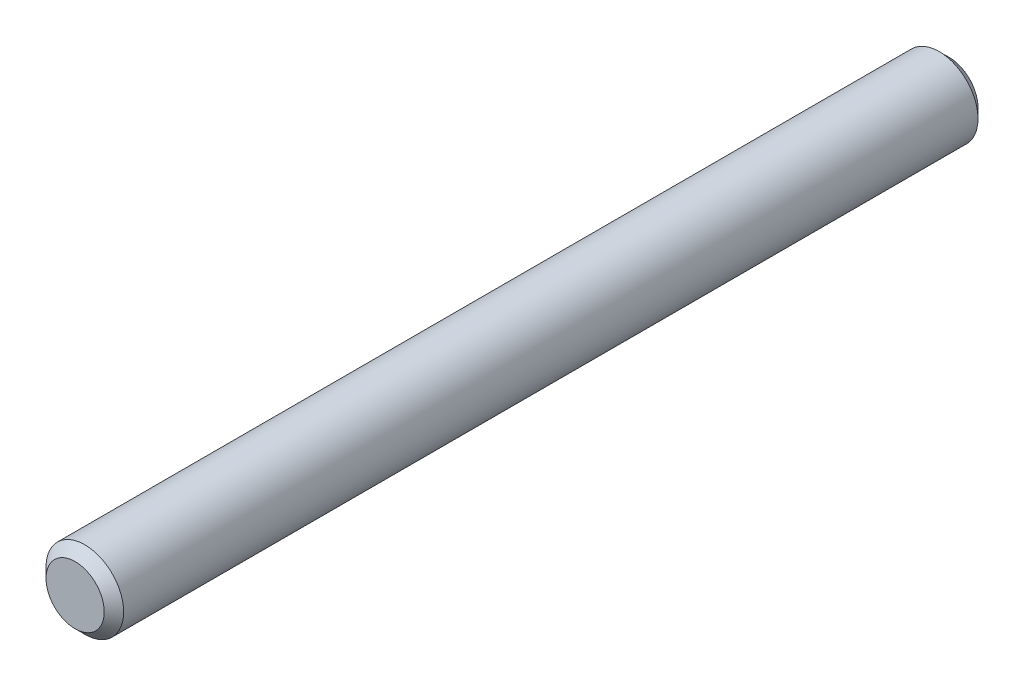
ISO-10303-21;
HEADER;
FILE_DESCRIPTION(('STEP AP214'),'2;1');
FILE_NAME('part.step','',(''),(''),'','','');
FILE_SCHEMA(('AUTOMOTIVE_DESIGN { 1 0 10303 214 1 1 1 1 }'));
ENDSEC;
DATA;
#1=APPLICATION_CONTEXT('core data for automotive mechanical design processes');
#2=APPLICATION_PROTOCOL_DEFINITION('international standard','automotive_design',2000,#1);
#3=PRODUCT_CONTEXT('',#1,'mechanical');
#4=PRODUCT('Part','Part','',(#3));
#5=PRODUCT_RELATED_PRODUCT_CATEGORY('part','',(#4));
#6=PRODUCT_DEFINITION_FORMATION('','',#4);
#7=PRODUCT_DEFINITION_CONTEXT('part definition',#1,'design');
#8=PRODUCT_DEFINITION('design','',#6,#7);
#9=PRODUCT_DEFINITION_SHAPE('','',#8);
#10=(LENGTH_UNIT() NAMED_UNIT(*) SI_UNIT(.MILLI.,.METRE.));
#11=(NAMED_UNIT(*) PLANE_ANGLE_UNIT() SI_UNIT($,.RADIAN.));
#12=(NAMED_UNIT(*) SI_UNIT($,.STERADIAN.) SOLID_ANGLE_UNIT());
#13=UNCERTAINTY_MEASURE_WITH_UNIT(LENGTH_MEASURE(1.E-05),#10,'distance_accuracy_value','');
#14=(GEOMETRIC_REPRESENTATION_CONTEXT(3) GLOBAL_UNCERTAINTY_ASSIGNED_CONTEXT((#13)) GLOBAL_UNIT_ASSIGNED_CONTEXT((#10,
#11,#12)) REPRESENTATION_CONTEXT('',''));
#15=CARTESIAN_POINT('',(0.,0.,0.));
#16=DIRECTION('',(0.,0.,1.));
#17=DIRECTION('',(1.,0.,0.));
#18=AXIS2_PLACEMENT_3D('',#15,#16,#17);
#19=CARTESIAN_POINT('',(16.875,-2.52164262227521,20.));
#20=DIRECTION('',(0.,0.,-1.));
#21=DIRECTION('',(-1.,0.,0.));
#22=AXIS2_PLACEMENT_3D('',#19,#20,#21);
#23=CYLINDRICAL_SURFACE('',#22,1.);
#24=CARTESIAN_POINT('',(16.875,-2.52164262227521,-2.25));
#25=DIRECTION('',(0.,0.,1.));
#26=DIRECTION('',(1.,0.,0.));
#27=AXIS2_PLACEMENT_3D('',#24,#25,#26);
#28=CIRCLE('',#27,1.);
#29=CARTESIAN_POINT('',(17.875,-2.52164262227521,-2.25));
#30=VERTEX_POINT('',#29);
#31=EDGE_CURVE('E37',#30,#30,#28,.T.);
#32=ORIENTED_EDGE('',*,*,#31,.T.);
#33=EDGE_LOOP('',(#32));
#34=FACE_BOUND('',#33,.T.);
#35=CARTESIAN_POINT('',(16.875,-2.52164262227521,19.75));
#36=DIRECTION('',(0.,0.,1.));
#37=DIRECTION('',(1.,0.,0.));
#38=AXIS2_PLACEMENT_3D('',#35,#36,#37);
#39=CIRCLE('',#38,1.);
#40=CARTESIAN_POINT('',(17.875,-2.52164262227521,19.75));
#41=VERTEX_POINT('',#40);
#42=EDGE_CURVE('E41',#41,#41,#39,.F.);
#43=ORIENTED_EDGE('',*,*,#42,.T.);
#44=EDGE_LOOP('',(#43));
#45=FACE_BOUND('',#44,.T.);
#46=ADVANCED_FACE('F27',(#34,#45),#23,.T.);
#47=CARTESIAN_POINT('',(16.875,-2.52164262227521,20.));
#48=DIRECTION('',(0.,0.,1.));
#49=DIRECTION('',(1.,0.,0.));
#50=AXIS2_PLACEMENT_3D('',#47,#48,#49);
#51=PLANE('',#50);
#52=CARTESIAN_POINT('',(16.875,-2.52164262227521,20.));
#53=DIRECTION('',(0.,0.,1.));
#54=DIRECTION('',(1.,0.,0.));
#55=AXIS2_PLACEMENT_3D('',#52,#53,#54);
#56=CIRCLE('',#55,0.749999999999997);
#57=CARTESIAN_POINT('',(17.625,-2.52164262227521,20.));
#58=VERTEX_POINT('',#57);
#59=EDGE_CURVE('E10',#58,#58,#56,.T.);
#60=ORIENTED_EDGE('',*,*,#59,.T.);
#61=EDGE_LOOP('',(#60));
#62=FACE_BOUND('',#61,.T.);
#63=ADVANCED_FACE('F60',(#62),#51,.T.);
#64=CARTESIAN_POINT('',(16.875,-2.52164262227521,-2.5));
#65=DIRECTION('',(0.,0.,1.));
#66=DIRECTION('',(1.,0.,0.));
#67=AXIS2_PLACEMENT_3D('',#64,#65,#66);
#68=PLANE('',#67);
#69=CARTESIAN_POINT('',(16.875,-2.52164262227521,-2.5));
#70=DIRECTION('',(0.,0.,1.));
#71=DIRECTION('',(1.,0.,0.));
#72=AXIS2_PLACEMENT_3D('',#69,#70,#71);
#73=CIRCLE('',#72,0.750000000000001);
#74=CARTESIAN_POINT('',(17.625,-2.52164262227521,-2.5));
#75=VERTEX_POINT('',#74);
#76=EDGE_CURVE('E33',#75,#75,#73,.F.);
#77=ORIENTED_EDGE('',*,*,#76,.T.);
#78=EDGE_LOOP('',(#77));
#79=FACE_BOUND('',#78,.T.);
#80=ADVANCED_FACE('F56',(#79),#68,.F.);
#81=CARTESIAN_POINT('',(16.875,-2.52164262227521,-2.25));
#82=DIRECTION('',(0.,0.,1.));
#83=DIRECTION('',(1.,0.,0.));
#84=AXIS2_PLACEMENT_3D('',#81,#82,#83);
#85=CONICAL_SURFACE('',#84,1.,0.785398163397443);
#86=ORIENTED_EDGE('',*,*,#76,.F.);
#87=EDGE_LOOP('',(#86));
#88=FACE_BOUND('',#87,.T.);
#89=ORIENTED_EDGE('',*,*,#31,.F.);
#90=EDGE_LOOP('',(#89));
#91=FACE_BOUND('',#90,.T.);
#92=ADVANCED_FACE('F51',(#88,#91),#85,.T.);
#93=CARTESIAN_POINT('',(16.875,-2.52164262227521,20.));
#94=DIRECTION('',(0.,0.,-1.));
#95=DIRECTION('',(-1.,0.,0.));
#96=AXIS2_PLACEMENT_3D('',#93,#94,#95);
#97=CONICAL_SURFACE('',#96,0.749999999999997,0.785398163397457);
#98=ORIENTED_EDGE('',*,*,#42,.F.);
#99=EDGE_LOOP('',(#98));
#100=FACE_BOUND('',#99,.T.);
#101=ORIENTED_EDGE('',*,*,#59,.F.);
#102=EDGE_LOOP('',(#101));
#103=FACE_BOUND('',#102,.T.);
#104=ADVANCED_FACE('F48',(#100,#103),#97,.T.);
#105=CLOSED_SHELL('',(#46,#63,#80,#92,#104));
#106=MANIFOLD_SOLID_BREP('B2',#105);
#107=ADVANCED_BREP_SHAPE_REPRESENTATION('',(#18,#106),#14);
#108=SHAPE_DEFINITION_REPRESENTATION(#9,#107);
ENDSEC;
END-ISO-10303-21;
